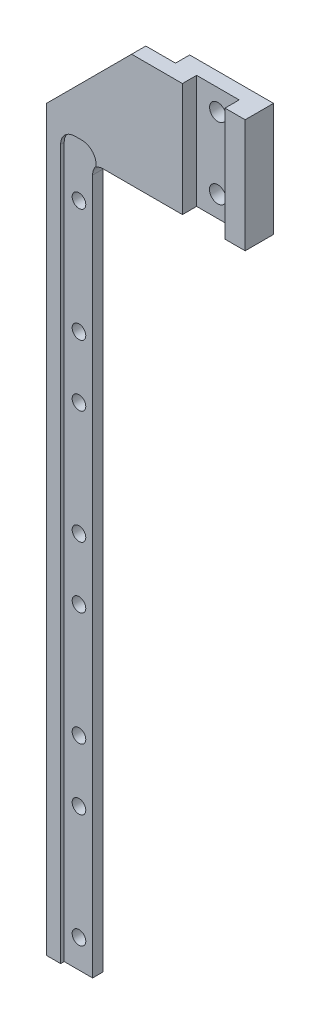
from build123d import *

# Parameters (mm, degrees)
EXTRUDE1_DEPTH              = 3.175
FILLET2_R                   = 1.5875
CUT_EXTRUDE1_DEPTH          = 0.396875
F_0_80_TAPPED_HOLE1_D       = 1.524
SKETCH6_W                   = 4.7625
SKETCH6_H                   = 4.5640625
CUT_EXTRUDE2_DEPTH          = 96.495366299
F_49_0_073_DIAMETER_HOLE1_D = 1.8542
SKETCH10_W                  = 15.658973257
SKETCH10_H                  = 2.942722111
CUT_EXTRUDE3_DEPTH          = 94.770065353


with BuildPart() as part:
    # Sketch1 → Extrude1 (new body)
    with BuildSketch(Plane.XY):
        Polygon((-7.9375, 82.55), (-17.4625, 73.025), (-17.4625, -9.525), (-12.7, -9.525), (-12.7, 69.85), (4.7625, 69.85), (4.7625, 82.55), align=None)
    extrude(amount=EXTRUDE1_DEPTH)

    # Fillet2
    fillet2_edges = [part.edges().sort_by_distance(p)[0] for p in [
        (-12.7, 69.85, 1.5875),
    ]]
    fillet(fillet2_edges, radius=FILLET2_R)

    # Sketch2 → Cut-Extrude1 (cut)
    with BuildSketch(Plane.XY.offset(3.175)):
        with BuildLine():
            Line((-13.49375, 71.4375), (-14.2875, 71.4375))
            ThreePointArc((-14.2875, 71.4375), (-15.410032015, 70.972532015), (-15.875, 69.85))
            Line((-15.875, 69.85), (-15.875, -12.7))
            Line((-15.875, -12.7), (-11.90625, -12.7))
            Line((-11.90625, -12.7), (-11.90625, 69.85))
            ThreePointArc((-11.90625, 69.85), (-12.371217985, 70.972532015), (-13.49375, 71.4375))
        make_face()
    extrude(amount=-CUT_EXTRUDE1_DEPTH, mode=Mode.SUBTRACT)

    # 0-80 Tapped Hole1 (through all)
    with Locations(Plane.XY.offset(2.778125)):
        with Locations((-14.224, 65.024), (-14.224, 52.324), (-14.224, 45.466), (-14.224, 32.766), (-14.224, 25.908), (-14.224, 13.208), (-14.224, 6.35), (-14.224, -6.35)):
            Hole(F_0_80_TAPPED_HOLE1_D / 2)

    # Sketch6 → Cut-Extrude2 (cut, through all)
    with BuildSketch(Plane(origin=(-20.445825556, 82.55, 0.705246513), x_dir=(-1, 0, 0), z_dir=(0, 1, 0))):
        with Locations((-20.572825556, 3.164284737)):
            Rectangle(SKETCH6_W, SKETCH6_H)
    extrude(amount=-CUT_EXTRUDE2_DEPTH, mode=Mode.SUBTRACT)

    # 49 _0.073_ Diameter Hole1 (through all)
    with Locations(Plane(origin=(0, 0, 0), x_dir=(-1, 0, 0), z_dir=(0, 0, -1))):
        with Locations((-0.111095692, 72.2122), (-0.123365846, 80.1878)):
            Hole(F_49_0_073_DIAMETER_HOLE1_D / 2)

    # Sketch10 → Cut-Extrude3 (cut, through all)
    with BuildSketch(Plane.XZ.offset(9.525)):
        with Locations((-12.445936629, 0.116138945)):
            Rectangle(SKETCH10_W, SKETCH10_H)
    extrude(amount=-CUT_EXTRUDE3_DEPTH, mode=Mode.SUBTRACT)


solid = part.part
